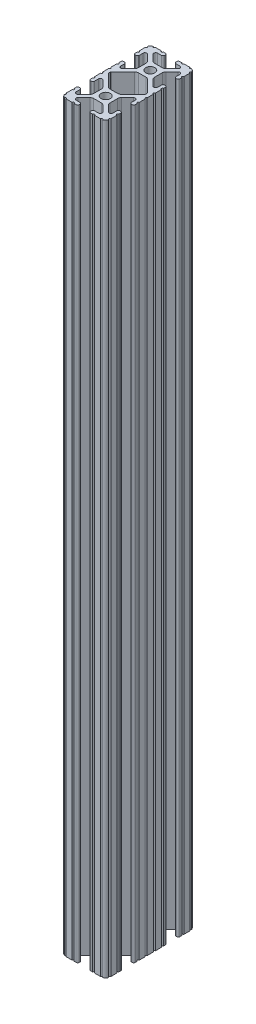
from build123d import *

# Parameters (mm, degrees)
SKETCH41_R                            = 2.6035
AL_EXTRUSIONS_2X1_T_SLOT_1020_2_DEPTH = 423.004233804


with BuildPart() as part:
    # Sketch41 → Al extrusions 2X1 T-SLOT 1020_2 (new body)
    with BuildSketch(Plane.XZ.offset(-423.004233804)):
        with BuildLine():
            Line((-2.16399369, -17.3482), (2.16399369, -17.3482))
            ThreePointArc((2.16399369, -17.3482), (3.015479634, -17.517571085), (3.737334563, -17.999899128))
            Line((3.737334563, -17.999899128), (7.103895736, -21.366460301))
            ThreePointArc((7.103895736, -21.366460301), (7.335478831, -22.530707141), (6.348478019, -23.1902))
            Line((6.348478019, -23.1902), (4.190365, -23.1902))
            ThreePointArc((4.190365, -23.1902), (3.52627506, -23.46527506), (3.2512, -24.129365))
            Line((3.2512, -24.129365), (3.2512, -24.460835))
            ThreePointArc((3.2512, -24.460835), (3.52627506, -25.12492494), (4.190365, -25.4))
            Line((4.190365, -25.4), (5.243578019, -25.4))
            ThreePointArc((5.243578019, -25.4), (5.796028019, -24.84755), (6.348478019, -25.4))
            Line((6.348478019, -25.4), (9.803703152, -25.4))
            ThreePointArc((9.803703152, -25.4), (10.295790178, -24.850857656), (10.895412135, -25.279996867))
            ThreePointArc((10.895412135, -25.279996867), (11.943543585, -24.643543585), (12.579996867, -23.595412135))
            ThreePointArc((12.579996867, -23.595412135), (12.150857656, -22.995790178), (12.7, -22.503703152))
            Line((12.7, -22.503703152), (12.7, -19.048478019))
            ThreePointArc((12.7, -19.048478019), (12.14755, -18.496028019), (12.7, -17.943578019))
            Line((12.7, -17.943578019), (12.7, -16.890365))
            ThreePointArc((12.7, -16.890365), (12.42492494, -16.22627506), (11.760835, -15.9512))
            Line((11.760835, -15.9512), (11.429365, -15.9512))
            ThreePointArc((11.429365, -15.9512), (10.76527506, -16.22627506), (10.4902, -16.890365))
            Line((10.4902, -16.890365), (10.4902, -19.048478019))
            ThreePointArc((10.4902, -19.048478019), (9.830707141, -20.035478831), (8.666460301, -19.803895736))
            Line((8.666460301, -19.803895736), (5.299899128, -16.437334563))
            ThreePointArc((5.299899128, -16.437334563), (4.817571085, -15.715479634), (4.6482, -14.86399369))
            Line((4.6482, -14.86399369), (4.6482, -10.53600631))
            ThreePointArc((4.6482, -10.53600631), (4.817571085, -9.684520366), (5.299899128, -8.962665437))
            Line((5.299899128, -8.962665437), (8.666460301, -5.596104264))
            ThreePointArc((8.666460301, -5.596104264), (9.830707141, -5.364521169), (10.4902, -6.351521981))
            Line((10.4902, -6.351521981), (10.4902, -8.509635))
            ThreePointArc((10.4902, -8.509635), (10.76527506, -9.17372494), (11.429365, -9.4488))
            Line((11.429365, -9.4488), (11.760835, -9.4488))
            ThreePointArc((11.760835, -9.4488), (12.42492494, -9.17372494), (12.7, -8.509635))
            Line((12.7, -8.509635), (12.7, -7.456421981))
            ThreePointArc((12.7, -7.456421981), (12.14755, -6.903971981), (12.7, -6.351521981))
            Line((12.7, -6.351521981), (12.7, -2.896296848))
            ThreePointArc((12.7, -2.896296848), (12.14755, -2.343846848), (12.7, -1.791396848))
            Line((12.7, -1.791396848), (12.7, 1.791396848))
            ThreePointArc((12.7, 1.791396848), (12.14755, 2.343846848), (12.7, 2.896296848))
            Line((12.7, 2.896296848), (12.7, 6.351521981))
            ThreePointArc((12.7, 6.351521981), (12.14755, 6.903971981), (12.7, 7.456421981))
            Line((12.7, 7.456421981), (12.7, 8.509635))
            ThreePointArc((12.7, 8.509635), (12.42492494, 9.17372494), (11.760835, 9.4488))
            Line((11.760835, 9.4488), (11.429365, 9.4488))
            ThreePointArc((11.429365, 9.4488), (10.76527506, 9.17372494), (10.4902, 8.509635))
            Line((10.4902, 8.509635), (10.4902, 6.351521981))
            ThreePointArc((10.4902, 6.351521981), (9.830707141, 5.364521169), (8.666460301, 5.596104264))
            Line((8.666460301, 5.596104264), (5.299899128, 8.962665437))
            ThreePointArc((5.299899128, 8.962665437), (4.817571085, 9.684520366), (4.6482, 10.53600631))
            Line((4.6482, 10.53600631), (4.6482, 14.86399369))
            ThreePointArc((4.6482, 14.86399369), (4.817571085, 15.715479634), (5.299899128, 16.437334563))
            Line((5.299899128, 16.437334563), (8.666460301, 19.803895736))
            ThreePointArc((8.666460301, 19.803895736), (9.830707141, 20.035478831), (10.4902, 19.048478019))
            Line((10.4902, 19.048478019), (10.4902, 16.890365))
            ThreePointArc((10.4902, 16.890365), (10.76527506, 16.22627506), (11.429365, 15.9512))
            Line((11.429365, 15.9512), (11.760835, 15.9512))
            ThreePointArc((11.760835, 15.9512), (12.42492494, 16.22627506), (12.7, 16.890365))
            Line((12.7, 16.890365), (12.7, 17.943578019))
            ThreePointArc((12.7, 17.943578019), (12.14755, 18.496028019), (12.7, 19.048478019))
            Line((12.7, 19.048478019), (12.7, 22.503703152))
            ThreePointArc((12.7, 22.503703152), (12.150857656, 22.995790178), (12.579996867, 23.595412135))
            ThreePointArc((12.579996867, 23.595412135), (11.943543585, 24.643543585), (10.895412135, 25.279996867))
            ThreePointArc((10.895412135, 25.279996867), (10.295790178, 24.850857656), (9.803703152, 25.4))
            Line((9.803703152, 25.4), (6.348478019, 25.4))
            ThreePointArc((6.348478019, 25.4), (5.796028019, 24.84755), (5.243578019, 25.4))
            Line((5.243578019, 25.4), (4.190365, 25.4))
            ThreePointArc((4.190365, 25.4), (3.52627506, 25.12492494), (3.2512, 24.460835))
            Line((3.2512, 24.460835), (3.2512, 24.129365))
            ThreePointArc((3.2512, 24.129365), (3.52627506, 23.46527506), (4.190365, 23.1902))
            Line((4.190365, 23.1902), (6.348478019, 23.1902))
            ThreePointArc((6.348478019, 23.1902), (7.335478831, 22.530707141), (7.103895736, 21.366460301))
            Line((7.103895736, 21.366460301), (3.737334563, 17.999899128))
            ThreePointArc((3.737334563, 17.999899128), (3.015479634, 17.517571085), (2.16399369, 17.3482))
            Line((2.16399369, 17.3482), (-2.16399369, 17.3482))
            ThreePointArc((-2.16399369, 17.3482), (-3.015479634, 17.517571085), (-3.737334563, 17.999899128))
            Line((-3.737334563, 17.999899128), (-7.103895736, 21.366460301))
            ThreePointArc((-7.103895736, 21.366460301), (-7.335478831, 22.530707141), (-6.348478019, 23.1902))
            Line((-6.348478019, 23.1902), (-4.190365, 23.1902))
            ThreePointArc((-4.190365, 23.1902), (-3.52627506, 23.46527506), (-3.2512, 24.129365))
            Line((-3.2512, 24.129365), (-3.2512, 24.460835))
            ThreePointArc((-3.2512, 24.460835), (-3.52627506, 25.12492494), (-4.190365, 25.4))
            Line((-4.190365, 25.4), (-5.243578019, 25.4))
            ThreePointArc((-5.243578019, 25.4), (-5.796028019, 24.84755), (-6.348478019, 25.4))
            Line((-6.348478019, 25.4), (-9.803703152, 25.4))
            ThreePointArc((-9.803703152, 25.4), (-10.295790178, 24.850857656), (-10.895412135, 25.279996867))
            ThreePointArc((-10.895412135, 25.279996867), (-11.943543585, 24.643543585), (-12.579996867, 23.595412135))
            ThreePointArc((-12.579996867, 23.595412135), (-12.150857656, 22.995790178), (-12.7, 22.503703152))
            Line((-12.7, 22.503703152), (-12.7, 19.048478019))
            ThreePointArc((-12.7, 19.048478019), (-12.14755, 18.496028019), (-12.7, 17.943578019))
            Line((-12.7, 17.943578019), (-12.7, 16.890365))
            ThreePointArc((-12.7, 16.890365), (-12.42492494, 16.22627506), (-11.760835, 15.9512))
            Line((-11.760835, 15.9512), (-11.429365, 15.9512))
            ThreePointArc((-11.429365, 15.9512), (-10.76527506, 16.22627506), (-10.4902, 16.890365))
            Line((-10.4902, 16.890365), (-10.4902, 19.048478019))
            ThreePointArc((-10.4902, 19.048478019), (-9.830707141, 20.035478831), (-8.666460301, 19.803895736))
            Line((-8.666460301, 19.803895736), (-5.299899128, 16.437334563))
            ThreePointArc((-5.299899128, 16.437334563), (-4.817571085, 15.715479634), (-4.6482, 14.86399369))
            Line((-4.6482, 14.86399369), (-4.6482, 10.53600631))
            ThreePointArc((-4.6482, 10.53600631), (-4.817571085, 9.684520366), (-5.299899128, 8.962665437))
            Line((-5.299899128, 8.962665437), (-8.666460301, 5.596104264))
            ThreePointArc((-8.666460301, 5.596104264), (-9.830707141, 5.364521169), (-10.4902, 6.351521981))
            Line((-10.4902, 6.351521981), (-10.4902, 8.509635))
            ThreePointArc((-10.4902, 8.509635), (-10.76527506, 9.17372494), (-11.429365, 9.4488))
            Line((-11.429365, 9.4488), (-11.760835, 9.4488))
            ThreePointArc((-11.760835, 9.4488), (-12.42492494, 9.17372494), (-12.7, 8.509635))
            Line((-12.7, 8.509635), (-12.7, 7.456421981))
            ThreePointArc((-12.7, 7.456421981), (-12.14755, 6.903971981), (-12.7, 6.351521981))
            Line((-12.7, 6.351521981), (-12.7, 2.896296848))
            ThreePointArc((-12.7, 2.896296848), (-12.14755, 2.343846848), (-12.7, 1.791396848))
            Line((-12.7, 1.791396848), (-12.7, -1.791396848))
            ThreePointArc((-12.7, -1.791396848), (-12.14755, -2.343846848), (-12.7, -2.896296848))
            Line((-12.7, -2.896296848), (-12.7, -6.351521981))
            ThreePointArc((-12.7, -6.351521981), (-12.14755, -6.903971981), (-12.7, -7.456421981))
            Line((-12.7, -7.456421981), (-12.7, -8.509635))
            ThreePointArc((-12.7, -8.509635), (-12.42492494, -9.17372494), (-11.760835, -9.4488))
            Line((-11.760835, -9.4488), (-11.429365, -9.4488))
            ThreePointArc((-11.429365, -9.4488), (-10.76527506, -9.17372494), (-10.4902, -8.509635))
            Line((-10.4902, -8.509635), (-10.4902, -6.351521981))
            ThreePointArc((-10.4902, -6.351521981), (-9.830707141, -5.364521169), (-8.666460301, -5.596104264))
            Line((-8.666460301, -5.596104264), (-5.299899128, -8.962665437))
            ThreePointArc((-5.299899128, -8.962665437), (-4.817571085, -9.684520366), (-4.6482, -10.53600631))
            Line((-4.6482, -10.53600631), (-4.6482, -14.86399369))
            ThreePointArc((-4.6482, -14.86399369), (-4.817571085, -15.715479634), (-5.299899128, -16.437334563))
            Line((-5.299899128, -16.437334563), (-8.666460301, -19.803895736))
            ThreePointArc((-8.666460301, -19.803895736), (-9.830707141, -20.035478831), (-10.4902, -19.048478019))
            Line((-10.4902, -19.048478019), (-10.4902, -16.890365))
            ThreePointArc((-10.4902, -16.890365), (-10.76527506, -16.22627506), (-11.429365, -15.9512))
            Line((-11.429365, -15.9512), (-11.760835, -15.9512))
            ThreePointArc((-11.760835, -15.9512), (-12.42492494, -16.22627506), (-12.7, -16.890365))
            Line((-12.7, -16.890365), (-12.7, -17.943578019))
            ThreePointArc((-12.7, -17.943578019), (-12.14755, -18.496028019), (-12.7, -19.048478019))
            Line((-12.7, -19.048478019), (-12.7, -22.503703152))
            ThreePointArc((-12.7, -22.503703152), (-12.150857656, -22.995790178), (-12.579996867, -23.595412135))
            ThreePointArc((-12.579996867, -23.595412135), (-11.943543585, -24.643543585), (-10.895412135, -25.279996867))
            ThreePointArc((-10.895412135, -25.279996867), (-10.295790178, -24.850857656), (-9.803703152, -25.4))
            Line((-9.803703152, -25.4), (-6.348478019, -25.4))
            ThreePointArc((-6.348478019, -25.4), (-5.796028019, -24.84755), (-5.243578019, -25.4))
            Line((-5.243578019, -25.4), (-4.190365, -25.4))
            ThreePointArc((-4.190365, -25.4), (-3.52627506, -25.12492494), (-3.2512, -24.460835))
            Line((-3.2512, -24.460835), (-3.2512, -24.129365))
            ThreePointArc((-3.2512, -24.129365), (-3.52627506, -23.46527506), (-4.190365, -23.1902))
            Line((-4.190365, -23.1902), (-6.348478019, -23.1902))
            ThreePointArc((-6.348478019, -23.1902), (-7.335478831, -22.530707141), (-7.103895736, -21.366460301))
            Line((-7.103895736, -21.366460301), (-3.737334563, -17.999899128))
            ThreePointArc((-3.737334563, -17.999899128), (-3.015479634, -17.517571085), (-2.16399369, -17.3482))
        make_face()
        with Locations((0, -12.7)):
            Circle(SKETCH41_R, mode=Mode.SUBTRACT)
        with Locations((0, 12.7)):
            Circle(SKETCH41_R, mode=Mode.SUBTRACT)
        with BuildLine():
            Line((-2.16399369, -8.0518), (2.16399369, -8.0518))
            ThreePointArc((2.16399369, -8.0518), (3.015479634, -7.882428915), (3.737334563, -7.400100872))
            Line((3.737334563, -7.400100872), (10.328391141, -0.809044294))
            ThreePointArc((10.328391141, -0.809044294), (10.448147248, -0.629816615), (10.4902, -0.418403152))
            Line((10.4902, -0.418403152), (10.4902, 0.418403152))
            ThreePointArc((10.4902, 0.418403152), (10.448147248, 0.629816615), (10.328391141, 0.809044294))
            Line((10.328391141, 0.809044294), (3.737334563, 7.400100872))
            ThreePointArc((3.737334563, 7.400100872), (3.015479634, 7.882428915), (2.16399369, 8.0518))
            Line((2.16399369, 8.0518), (-2.16399369, 8.0518))
            ThreePointArc((-2.16399369, 8.0518), (-3.015479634, 7.882428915), (-3.737334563, 7.400100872))
            Line((-3.737334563, 7.400100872), (-10.328391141, 0.809044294))
            ThreePointArc((-10.328391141, 0.809044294), (-10.448147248, 0.629816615), (-10.4902, 0.418403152))
            Line((-10.4902, 0.418403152), (-10.4902, -0.418403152))
            ThreePointArc((-10.4902, -0.418403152), (-10.448147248, -0.629816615), (-10.328391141, -0.809044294))
            Line((-10.328391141, -0.809044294), (-3.737334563, -7.400100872))
            ThreePointArc((-3.737334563, -7.400100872), (-3.015479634, -7.882428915), (-2.16399369, -8.0518))
        make_face(mode=Mode.SUBTRACT)
    extrude(amount=AL_EXTRUSIONS_2X1_T_SLOT_1020_2_DEPTH)


solid = part.part
